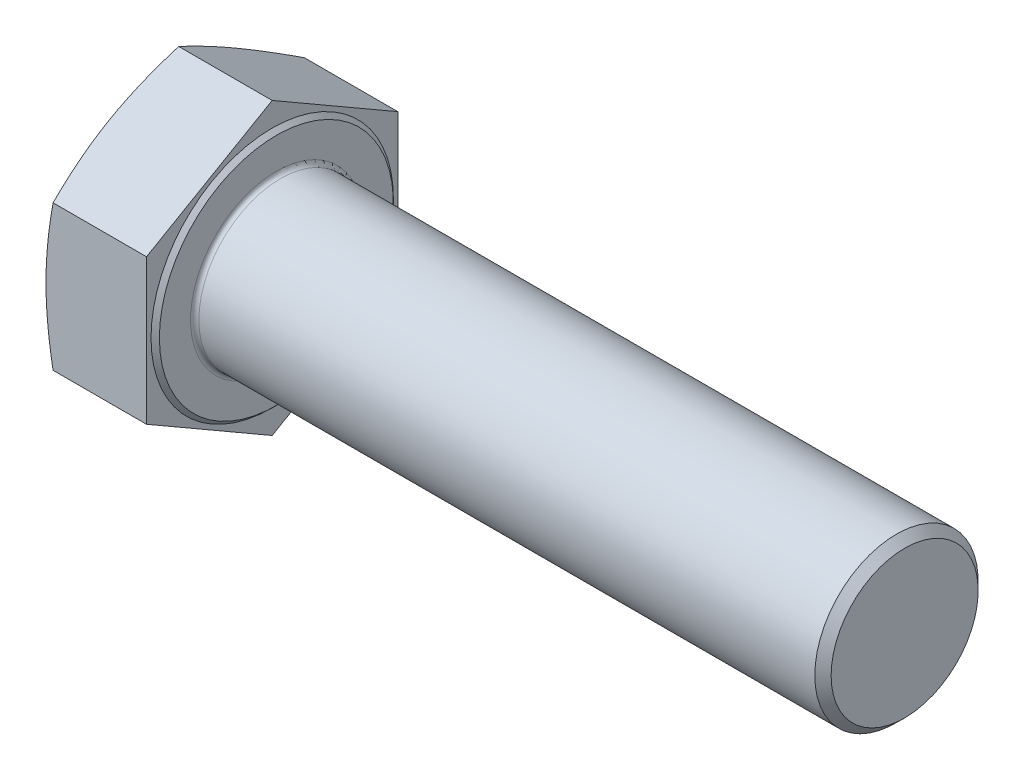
from build123d import *

# Parameters (mm, degrees)
BASEHEAD_DEPTH = 25
SKETCH5_R      = 19.5
BASEBODY_DEPTH = 150
CHAMFER1_SIZE  = 1.95
HEADFILLET_R   = 1


with BuildPart() as part:
    # Sketch2 → BaseHead (new body)
    with BuildSketch(Plane(origin=(0, 0, 0), x_dir=(0, 0, -1), z_dir=(1, 0, 0))):
        Polygon((0, -34.641016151), (30, -17.320508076), (30, 17.320508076), (0, 34.641016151), (-30, 17.320508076), (-30, -17.320508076), align=None)
    extrude(amount=BASEHEAD_DEPTH)

    # Sketch3 → BearingFace (revolve, cut)
    with BuildSketch(Plane.XY, mode=Mode.PRIVATE) as bearingface_sk:
        Polygon((25, 34.641016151), (25, 27.93), (24, 28.93), (24, 34.641016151), align=None)
    revolve(bearingface_sk.sketch.rotate(Axis((-0.957090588, 0, 0), (1, 0, 0)), 90), axis=Axis((-0.957090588, 0, 0), (1, 0, 0)), mode=Mode.SUBTRACT)

    # Sketch4 → HeadChamfer (revolve, cut)
    with BuildSketch(Plane.XY):
        Polygon((0, 34.641016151), (1.689191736, 34.641016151), (0, 30), align=None)
    revolve(axis=Axis((-0.493528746, 0, 0), (1, 0, 0)), mode=Mode.SUBTRACT)

    # Sketch5 → BaseBody (add)
    with BuildSketch(Plane(origin=(25, 0, 0), x_dir=(0, 0, -1), z_dir=(1, 0, 0))):
        Circle(SKETCH5_R)
    extrude(amount=BASEBODY_DEPTH)

    # Chamfer1
    chamfer1_edges = [part.edges().sort_by_distance(p)[0] for p in [
        (175, 0, 19.5),
    ]]
    chamfer(chamfer1_edges, length=CHAMFER1_SIZE)

    # HeadFillet
    headfillet_edges = [part.edges().sort_by_distance(p)[0] for p in [
        (25, 0, 19.5),
    ]]
    fillet(headfillet_edges, radius=HEADFILLET_R)


solid = part.part
